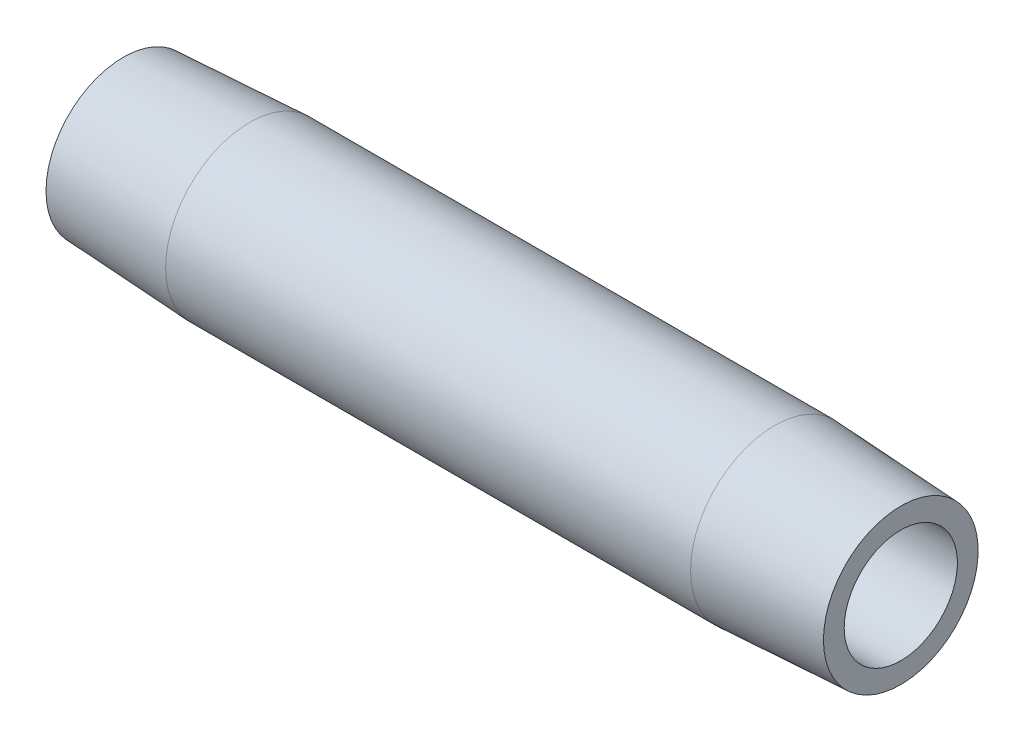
from build123d import *


with BuildPart() as part:
    # Sketch1 → Revolve1 (revolve)
    with BuildSketch(Plane(origin=(0, 0, 0), x_dir=(1, 0, 0), z_dir=(0, 1, 0)), mode=Mode.PRIVATE) as revolve1_sk:
        Polygon((63.5, 4.622776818), (0, 4.622776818), (0, 6.317526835), (10.3124, 6.857976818), (53.1876, 6.857976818), (63.5, 6.317526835), align=None)
    revolve(revolve1_sk.sketch.rotate(Axis((-6.375994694, 0, 0), (1, 0, 0)), 180), axis=Axis((-6.375994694, 0, 0), (1, 0, 0)))


solid = part.part
